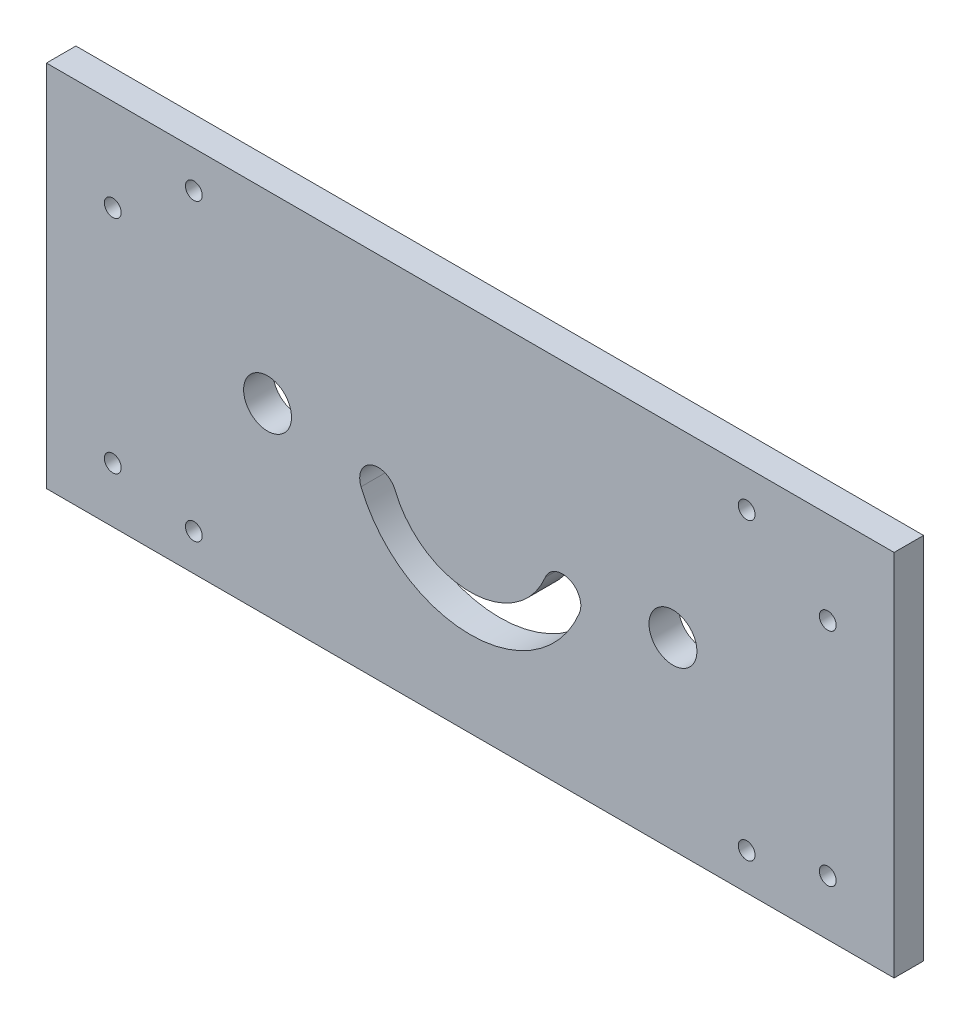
from build123d import *

# Parameters (mm, degrees)
SKETCH1_W           = 230
SKETCH1_H           = 100
SKETCH1_R           = 2.285
SKETCH1_R_2         = 6.5
BOSS_EXTRUDE1_DEPTH = 8


with BuildPart() as part:
    # Sketch1 → Boss-Extrude1 (new body)
    with BuildSketch(Plane.XY):
        Rectangle(SKETCH1_W, SKETCH1_H)
        with Locations((-97, 25)):
            Circle(SKETCH1_R, mode=Mode.SUBTRACT)
        with Locations((-97, -35)):
            Circle(SKETCH1_R, mode=Mode.SUBTRACT)
        with Locations((-75, -40)):
            Circle(SKETCH1_R, mode=Mode.SUBTRACT)
        with Locations(Location((75, -40, 0), (0, 0, 180))):
            Circle(SKETCH1_R, mode=Mode.SUBTRACT)
        with Locations(Location((97, -35, 0), (0, 0, 180))):
            Circle(SKETCH1_R, mode=Mode.SUBTRACT)
        with Locations(Location((97, 25, 0), (0, 0, 180))):
            Circle(SKETCH1_R, mode=Mode.SUBTRACT)
        with Locations((75, 40)):
            Circle(SKETCH1_R, mode=Mode.SUBTRACT)
        with Locations(Location((-75, 40, 0), (0, 0, 180))):
            Circle(SKETCH1_R, mode=Mode.SUBTRACT)
        with Locations((-55, 0)):
            Circle(SKETCH1_R_2, mode=Mode.SUBTRACT)
        with Locations(Location((55, 0, 0), (0, 0, 180))):
            Circle(SKETCH1_R_2, mode=Mode.SUBTRACT)
        with BuildLine():
            ThreePointArc((-29.631019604, -6.885114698), (-0.016046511, -26.820371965), (29.628239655, -6.928730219))
            ThreePointArc((29.628239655, -6.928730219), (26.891929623, -0.408560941), (20.371760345, -3.144870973))
            ThreePointArc((20.371760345, -3.144870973), (-0.008686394, -16.820374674), (-20.368980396, -3.114885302))
            ThreePointArc((-20.368980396, -3.114885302), (-26.885114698, -0.368980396), (-29.631019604, -6.885114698))
        make_face(mode=Mode.SUBTRACT)
    extrude(amount=BOSS_EXTRUDE1_DEPTH)


solid = part.part
